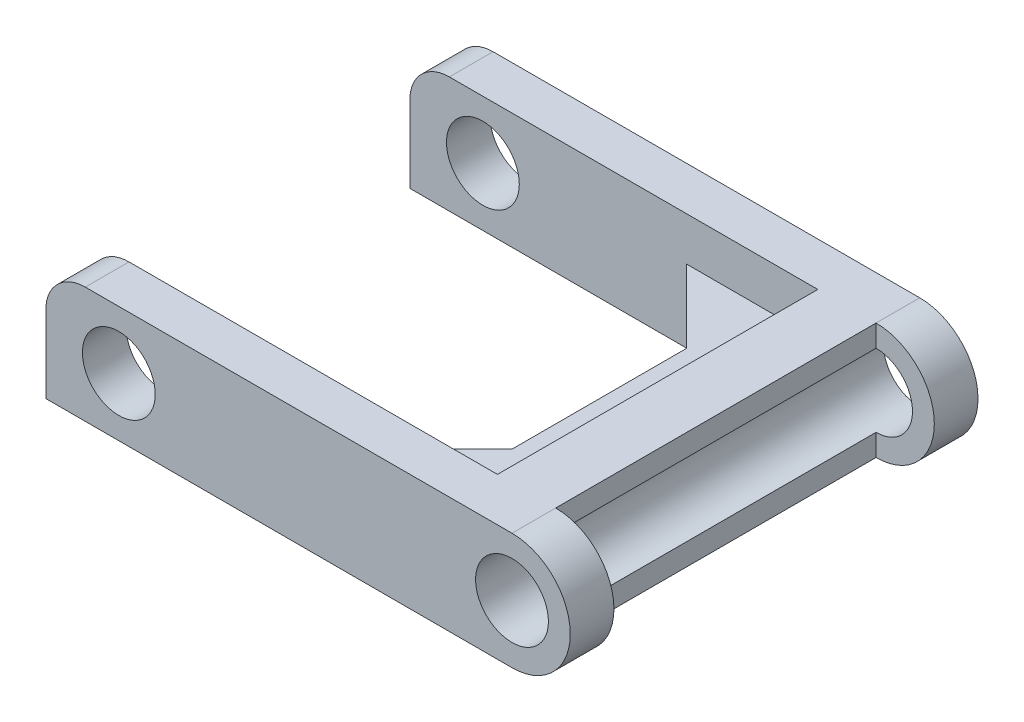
ISO-10303-21;
HEADER;
FILE_DESCRIPTION(('STEP AP214'),'2;1');
FILE_NAME('part.step','',(''),(''),'','','');
FILE_SCHEMA(('AUTOMOTIVE_DESIGN { 1 0 10303 214 1 1 1 1 }'));
ENDSEC;
DATA;
#1=APPLICATION_CONTEXT('core data for automotive mechanical design processes');
#2=APPLICATION_PROTOCOL_DEFINITION('international standard','automotive_design',2000,#1);
#3=PRODUCT_CONTEXT('',#1,'mechanical');
#4=PRODUCT('Part','Part','',(#3));
#5=PRODUCT_RELATED_PRODUCT_CATEGORY('part','',(#4));
#6=PRODUCT_DEFINITION_FORMATION('','',#4);
#7=PRODUCT_DEFINITION_CONTEXT('part definition',#1,'design');
#8=PRODUCT_DEFINITION('design','',#6,#7);
#9=PRODUCT_DEFINITION_SHAPE('','',#8);
#10=(LENGTH_UNIT() NAMED_UNIT(*) SI_UNIT(.MILLI.,.METRE.));
#11=(NAMED_UNIT(*) PLANE_ANGLE_UNIT() SI_UNIT($,.RADIAN.));
#12=(NAMED_UNIT(*) SI_UNIT($,.STERADIAN.) SOLID_ANGLE_UNIT());
#13=UNCERTAINTY_MEASURE_WITH_UNIT(LENGTH_MEASURE(1.E-05),#10,'distance_accuracy_value','');
#14=(GEOMETRIC_REPRESENTATION_CONTEXT(3) GLOBAL_UNCERTAINTY_ASSIGNED_CONTEXT((#13)) GLOBAL_UNIT_ASSIGNED_CONTEXT((#10,
#11,#12)) REPRESENTATION_CONTEXT('',''));
#15=CARTESIAN_POINT('',(0.,0.,0.));
#16=DIRECTION('',(0.,0.,1.));
#17=DIRECTION('',(1.,0.,0.));
#18=AXIS2_PLACEMENT_3D('',#15,#16,#17);
#19=CARTESIAN_POINT('',(109.496962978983,35.8309457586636,-1.50000024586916));
#20=DIRECTION('',(-1.,0.,0.));
#21=DIRECTION('',(0.,0.,1.));
#22=AXIS2_PLACEMENT_3D('',#19,#20,#21);
#23=PLANE('',#22);
#24=DIRECTION('',(0.,1.,0.));
#25=VECTOR('',#24,1.);
#26=CARTESIAN_POINT('',(109.496962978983,35.8309457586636,-12.5000001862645));
#27=LINE('',#26,#25);
#28=CARTESIAN_POINT('',(109.496962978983,38.3309458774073,-12.5000001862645));
#29=VERTEX_POINT('',#28);
#30=CARTESIAN_POINT('',(109.496962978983,39.8299193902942,-12.5000001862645));
#31=VERTEX_POINT('',#30);
#32=EDGE_CURVE('E234',#29,#31,#27,.T.);
#33=ORIENTED_EDGE('',*,*,#32,.F.);
#34=DIRECTION('',(0.,0.,-1.));
#35=VECTOR('',#34,1.);
#36=CARTESIAN_POINT('',(109.496962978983,38.3309458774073,-1.50000024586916));
#37=LINE('',#36,#35);
#38=CARTESIAN_POINT('',(109.496962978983,38.3309458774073,-1.50000024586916));
#39=VERTEX_POINT('',#38);
#40=EDGE_CURVE('E198',#39,#29,#37,.T.);
#41=ORIENTED_EDGE('',*,*,#40,.F.);
#42=DIRECTION('',(0.,1.,0.));
#43=VECTOR('',#42,1.);
#44=CARTESIAN_POINT('',(109.496962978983,35.8309457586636,-1.50000024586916));
#45=LINE('',#44,#43);
#46=CARTESIAN_POINT('',(109.496962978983,39.8299193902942,-1.50000024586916));
#47=VERTEX_POINT('',#46);
#48=EDGE_CURVE('E250',#39,#47,#45,.T.);
#49=ORIENTED_EDGE('',*,*,#48,.T.);
#50=DIRECTION('',(0.,0.,1.));
#51=VECTOR('',#50,1.);
#52=CARTESIAN_POINT('',(109.496962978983,39.8299193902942,-14.0000004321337));
#53=LINE('',#52,#51);
#54=EDGE_CURVE('E12',#31,#47,#53,.T.);
#55=ORIENTED_EDGE('',*,*,#54,.F.);
#56=EDGE_LOOP('',(#33,#41,#49,#55));
#57=FACE_BOUND('',#56,.T.);
#58=ADVANCED_FACE('F32',(#57),#23,.T.);
#59=CARTESIAN_POINT('',(111.496963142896,37.8309458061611,-14.0000004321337));
#60=DIRECTION('',(0.,0.,1.));
#61=DIRECTION('',(1.,0.,0.));
#62=AXIS2_PLACEMENT_3D('',#59,#60,#61);
#63=CYLINDRICAL_SURFACE('',#62,2.00000004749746);
#64=CARTESIAN_POINT('',(111.496963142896,37.8309458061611,-14.0000004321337));
#65=DIRECTION('',(0.,0.,1.));
#66=DIRECTION('',(1.,0.,0.));
#67=AXIS2_PLACEMENT_3D('',#64,#65,#66);
#68=CIRCLE('',#67,2.00000004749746);
#69=CARTESIAN_POINT('',(111.496963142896,35.8309457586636,-14.0000004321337));
#70=VERTEX_POINT('',#69);
#71=CARTESIAN_POINT('',(111.496962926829,39.8309458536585,-14.0000004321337));
#72=VERTEX_POINT('',#71);
#73=EDGE_CURVE('E291',#70,#72,#68,.T.);
#74=ORIENTED_EDGE('',*,*,#73,.T.);
#75=DIRECTION('',(0.,0.,1.));
#76=VECTOR('',#75,1.);
#77=CARTESIAN_POINT('',(111.496962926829,39.8309458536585,-14.0000004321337));
#78=LINE('',#77,#76);
#79=CARTESIAN_POINT('',(111.496962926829,39.8309458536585,-12.5000001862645));
#80=VERTEX_POINT('',#79);
#81=EDGE_CURVE('E332',#72,#80,#78,.T.);
#82=ORIENTED_EDGE('',*,*,#81,.T.);
#83=CARTESIAN_POINT('',(111.496963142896,37.8309458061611,-12.5000001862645));
#84=DIRECTION('',(0.,0.,1.));
#85=DIRECTION('',(1.,0.,0.));
#86=AXIS2_PLACEMENT_3D('',#83,#84,#85);
#87=CIRCLE('',#86,2.00000004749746);
#88=CARTESIAN_POINT('',(111.496963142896,35.8309457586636,-12.5000001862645));
#89=VERTEX_POINT('',#88);
#90=EDGE_CURVE('E256',#80,#89,#87,.F.);
#91=ORIENTED_EDGE('',*,*,#90,.T.);
#92=DIRECTION('',(0.,0.,1.));
#93=VECTOR('',#92,1.);
#94=CARTESIAN_POINT('',(111.496963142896,35.8309457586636,-14.0000004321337));
#95=LINE('',#94,#93);
#96=EDGE_CURVE('E319',#70,#89,#95,.T.);
#97=ORIENTED_EDGE('',*,*,#96,.F.);
#98=EDGE_LOOP('',(#74,#82,#91,#97));
#99=FACE_BOUND('',#98,.T.);
#100=ADVANCED_FACE('F34',(#99),#63,.T.);
#101=CARTESIAN_POINT('',(111.496963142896,39.8309458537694,-1.50000024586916));
#102=VERTEX_POINT('',#101);
#103=CARTESIAN_POINT('',(111.496962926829,39.8309458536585,0.));
#104=VERTEX_POINT('',#103);
#105=EDGE_CURVE('E306',#102,#104,#78,.T.);
#106=ORIENTED_EDGE('',*,*,#105,.T.);
#107=CARTESIAN_POINT('',(111.496963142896,37.8309458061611,0.));
#108=DIRECTION('',(0.,0.,1.));
#109=DIRECTION('',(1.,0.,0.));
#110=AXIS2_PLACEMENT_3D('',#107,#108,#109);
#111=CIRCLE('',#110,2.00000004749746);
#112=CARTESIAN_POINT('',(111.496963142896,35.8309457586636,0.));
#113=VERTEX_POINT('',#112);
#114=EDGE_CURVE('E288',#113,#104,#111,.T.);
#115=ORIENTED_EDGE('',*,*,#114,.F.);
#116=CARTESIAN_POINT('',(111.496963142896,35.8309457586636,-1.50000024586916));
#117=VERTEX_POINT('',#116);
#118=EDGE_CURVE('E323',#117,#113,#95,.T.);
#119=ORIENTED_EDGE('',*,*,#118,.F.);
#120=CARTESIAN_POINT('',(111.496963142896,37.8309458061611,-1.50000024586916));
#121=DIRECTION('',(0.,0.,-1.));
#122=DIRECTION('',(-1.,0.,0.));
#123=AXIS2_PLACEMENT_3D('',#120,#121,#122);
#124=CIRCLE('',#123,2.00000004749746);
#125=EDGE_CURVE('E238',#117,#102,#124,.F.);
#126=ORIENTED_EDGE('',*,*,#125,.T.);
#127=EDGE_LOOP('',(#106,#115,#119,#126));
#128=FACE_BOUND('',#127,.T.);
#129=ADVANCED_FACE('F371',(#128),#63,.T.);
#130=CARTESIAN_POINT('',(95.4969633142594,35.8309457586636,-14.0000004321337));
#131=DIRECTION('',(0.,-1.,0.));
#132=DIRECTION('',(0.,0.,-1.));
#133=AXIS2_PLACEMENT_3D('',#130,#131,#132);
#134=PLANE('',#133);
#135=DIRECTION('',(0.,0.,1.));
#136=VECTOR('',#135,1.);
#137=CARTESIAN_POINT('',(109.496962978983,35.8309457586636,-1.50000024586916));
#138=LINE('',#137,#136);
#139=CARTESIAN_POINT('',(109.496962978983,35.8309457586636,-12.5000001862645));
#140=VERTEX_POINT('',#139);
#141=CARTESIAN_POINT('',(109.496962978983,35.8309457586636,-1.50000024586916));
#142=VERTEX_POINT('',#141);
#143=EDGE_CURVE('E226',#140,#142,#138,.T.);
#144=ORIENTED_EDGE('',*,*,#143,.F.);
#145=DIRECTION('',(1.,0.,0.));
#146=VECTOR('',#145,1.);
#147=CARTESIAN_POINT('',(109.496962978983,35.8309457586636,-12.5000001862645));
#148=LINE('',#147,#146);
#149=CARTESIAN_POINT('',(95.4969633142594,35.8309457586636,-12.5000001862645));
#150=VERTEX_POINT('',#149);
#151=EDGE_CURVE('E221',#150,#140,#148,.T.);
#152=ORIENTED_EDGE('',*,*,#151,.F.);
#153=DIRECTION('',(0.,0.,1.));
#154=VECTOR('',#153,1.);
#155=CARTESIAN_POINT('',(95.4969633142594,35.8309457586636,-14.0000004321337));
#156=LINE('',#155,#154);
#157=CARTESIAN_POINT('',(95.4969633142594,35.8309457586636,-14.0000004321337));
#158=VERTEX_POINT('',#157);
#159=EDGE_CURVE('E324',#158,#150,#156,.T.);
#160=ORIENTED_EDGE('',*,*,#159,.F.);
#161=DIRECTION('',(1.,0.,0.));
#162=VECTOR('',#161,1.);
#163=CARTESIAN_POINT('',(95.4969633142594,35.8309457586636,-14.0000004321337));
#164=LINE('',#163,#162);
#165=EDGE_CURVE('E303',#158,#70,#164,.T.);
#166=ORIENTED_EDGE('',*,*,#165,.T.);
#167=ORIENTED_EDGE('',*,*,#96,.T.);
#168=DIRECTION('',(0.,0.,-1.));
#169=VECTOR('',#168,1.);
#170=CARTESIAN_POINT('',(111.496963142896,35.8309457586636,-12.5000001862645));
#171=LINE('',#170,#169);
#172=EDGE_CURVE('E231',#117,#89,#171,.T.);
#173=ORIENTED_EDGE('',*,*,#172,.F.);
#174=ORIENTED_EDGE('',*,*,#118,.T.);
#175=DIRECTION('',(1.,0.,0.));
#176=VECTOR('',#175,1.);
#177=CARTESIAN_POINT('',(95.4969633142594,35.8309457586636,0.));
#178=LINE('',#177,#176);
#179=CARTESIAN_POINT('',(95.4969633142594,35.8309457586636,0.));
#180=VERTEX_POINT('',#179);
#181=EDGE_CURVE('E294',#180,#113,#178,.T.);
#182=ORIENTED_EDGE('',*,*,#181,.F.);
#183=CARTESIAN_POINT('',(95.4969633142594,35.8309457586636,-1.50000024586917));
#184=VERTEX_POINT('',#183);
#185=EDGE_CURVE('E327',#184,#180,#156,.T.);
#186=ORIENTED_EDGE('',*,*,#185,.F.);
#187=DIRECTION('',(-1.,0.,0.));
#188=VECTOR('',#187,1.);
#189=CARTESIAN_POINT('',(104.996962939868,35.8309457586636,-1.50000024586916));
#190=LINE('',#189,#188);
#191=EDGE_CURVE('E229',#142,#184,#190,.T.);
#192=ORIENTED_EDGE('',*,*,#191,.F.);
#193=EDGE_LOOP('',(#144,#152,#160,#166,#167,#173,#174,#182,#186,#192));
#194=FACE_BOUND('',#193,.T.);
#195=ADVANCED_FACE('F444',(#194),#134,.T.);
#196=CARTESIAN_POINT('',(95.4969633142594,38.3309458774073,-14.0000004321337));
#197=DIRECTION('',(-1.,0.,0.));
#198=DIRECTION('',(0.,0.,1.));
#199=AXIS2_PLACEMENT_3D('',#196,#197,#198);
#200=PLANE('',#199);
#201=ORIENTED_EDGE('',*,*,#159,.T.);
#202=DIRECTION('',(0.,1.,0.));
#203=VECTOR('',#202,1.);
#204=CARTESIAN_POINT('',(95.4969633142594,35.8309457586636,-12.5000001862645));
#205=LINE('',#204,#203);
#206=CARTESIAN_POINT('',(95.4969633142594,38.6010464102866,-12.5000001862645));
#207=VERTEX_POINT('',#206);
#208=EDGE_CURVE('E235',#150,#207,#205,.T.);
#209=ORIENTED_EDGE('',*,*,#208,.T.);
#210=DIRECTION('',(0.,0.,1.));
#211=VECTOR('',#210,1.);
#212=CARTESIAN_POINT('',(95.4969633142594,38.6010464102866,-14.0000004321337));
#213=LINE('',#212,#211);
#214=CARTESIAN_POINT('',(95.4969633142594,38.6010464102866,-14.0000004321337));
#215=VERTEX_POINT('',#214);
#216=EDGE_CURVE('E275',#215,#207,#213,.T.);
#217=ORIENTED_EDGE('',*,*,#216,.F.);
#218=DIRECTION('',(0.,-1.,0.));
#219=VECTOR('',#218,1.);
#220=CARTESIAN_POINT('',(95.4969633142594,38.3309458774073,-14.0000004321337));
#221=LINE('',#220,#219);
#222=EDGE_CURVE('E300',#215,#158,#221,.T.);
#223=ORIENTED_EDGE('',*,*,#222,.T.);
#224=EDGE_LOOP('',(#201,#209,#217,#223));
#225=FACE_BOUND('',#224,.T.);
#226=ADVANCED_FACE('F449',(#225),#200,.T.);
#227=DIRECTION('',(0.,-1.,0.));
#228=VECTOR('',#227,1.);
#229=CARTESIAN_POINT('',(95.4969633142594,38.3309458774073,0.));
#230=LINE('',#229,#228);
#231=CARTESIAN_POINT('',(95.4969633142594,38.6010464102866,0.));
#232=VERTEX_POINT('',#231);
#233=EDGE_CURVE('E314',#232,#180,#230,.T.);
#234=ORIENTED_EDGE('',*,*,#233,.F.);
#235=DIRECTION('',(0.,0.,1.));
#236=VECTOR('',#235,1.);
#237=CARTESIAN_POINT('',(95.4969633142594,38.6010464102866,-14.0000004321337));
#238=LINE('',#237,#236);
#239=CARTESIAN_POINT('',(95.4969633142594,38.6010464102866,-1.50000024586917));
#240=VERTEX_POINT('',#239);
#241=EDGE_CURVE('E272',#240,#232,#238,.T.);
#242=ORIENTED_EDGE('',*,*,#241,.F.);
#243=DIRECTION('',(0.,1.,0.));
#244=VECTOR('',#243,1.);
#245=CARTESIAN_POINT('',(95.4969633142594,35.8309457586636,-1.50000024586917));
#246=LINE('',#245,#244);
#247=EDGE_CURVE('E245',#184,#240,#246,.T.);
#248=ORIENTED_EDGE('',*,*,#247,.F.);
#249=ORIENTED_EDGE('',*,*,#185,.T.);
#250=EDGE_LOOP('',(#234,#242,#248,#249));
#251=FACE_BOUND('',#250,.T.);
#252=ADVANCED_FACE('F467',(#251),#200,.T.);
#253=CARTESIAN_POINT('',(96.8476596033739,38.4659961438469,-14.0000004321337));
#254=DIRECTION('',(0.,0.,1.));
#255=DIRECTION('',(1.,0.,0.));
#256=AXIS2_PLACEMENT_3D('',#253,#254,#255);
#257=CYLINDRICAL_SURFACE('',#256,1.35743104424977);
#258=ORIENTED_EDGE('',*,*,#216,.T.);
#259=CARTESIAN_POINT('',(96.8476596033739,38.4659961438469,-12.5000001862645));
#260=DIRECTION('',(0.,0.,1.));
#261=DIRECTION('',(1.,0.,0.));
#262=AXIS2_PLACEMENT_3D('',#259,#260,#261);
#263=CIRCLE('',#262,1.35743104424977);
#264=CARTESIAN_POINT('',(96.8469629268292,39.8234270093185,-12.5000001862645));
#265=VERTEX_POINT('',#264);
#266=EDGE_CURVE('E269',#207,#265,#263,.F.);
#267=ORIENTED_EDGE('',*,*,#266,.T.);
#268=DIRECTION('',(0.,0.,1.));
#269=VECTOR('',#268,1.);
#270=CARTESIAN_POINT('',(96.8469629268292,39.8234270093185,-14.0000004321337));
#271=LINE('',#270,#269);
#272=CARTESIAN_POINT('',(96.8469629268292,39.8234270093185,-14.0000004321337));
#273=VERTEX_POINT('',#272);
#274=EDGE_CURVE('E328',#273,#265,#271,.T.);
#275=ORIENTED_EDGE('',*,*,#274,.F.);
#276=CARTESIAN_POINT('',(96.8476596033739,38.4659961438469,-14.0000004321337));
#277=DIRECTION('',(0.,0.,1.));
#278=DIRECTION('',(1.,0.,0.));
#279=AXIS2_PLACEMENT_3D('',#276,#277,#278);
#280=CIRCLE('',#279,1.35743104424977);
#281=EDGE_CURVE('E297',#273,#215,#280,.T.);
#282=ORIENTED_EDGE('',*,*,#281,.T.);
#283=EDGE_LOOP('',(#258,#267,#275,#282));
#284=FACE_BOUND('',#283,.T.);
#285=ADVANCED_FACE('F451',(#284),#257,.T.);
#286=CARTESIAN_POINT('',(96.8476596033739,38.4659961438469,-1.50000024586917));
#287=DIRECTION('',(0.,0.,-1.));
#288=DIRECTION('',(-1.,0.,0.));
#289=AXIS2_PLACEMENT_3D('',#286,#287,#288);
#290=CIRCLE('',#289,1.35743104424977);
#291=CARTESIAN_POINT('',(96.8469629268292,39.8234270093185,-1.50000024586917));
#292=VERTEX_POINT('',#291);
#293=EDGE_CURVE('E262',#292,#240,#290,.F.);
#294=ORIENTED_EDGE('',*,*,#293,.T.);
#295=ORIENTED_EDGE('',*,*,#241,.T.);
#296=CARTESIAN_POINT('',(96.8476596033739,38.4659961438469,0.));
#297=DIRECTION('',(0.,0.,1.));
#298=DIRECTION('',(1.,0.,0.));
#299=AXIS2_PLACEMENT_3D('',#296,#297,#298);
#300=CIRCLE('',#299,1.35743104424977);
#301=CARTESIAN_POINT('',(96.8469629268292,39.8234270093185,0.));
#302=VERTEX_POINT('',#301);
#303=EDGE_CURVE('E311',#302,#232,#300,.T.);
#304=ORIENTED_EDGE('',*,*,#303,.F.);
#305=EDGE_CURVE('E331',#292,#302,#271,.T.);
#306=ORIENTED_EDGE('',*,*,#305,.F.);
#307=EDGE_LOOP('',(#294,#295,#304,#306));
#308=FACE_BOUND('',#307,.T.);
#309=ADVANCED_FACE('F457',(#308),#257,.T.);
#310=CARTESIAN_POINT('',(111.496962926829,39.8309458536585,-14.0000004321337));
#311=DIRECTION('',(-0.000513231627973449,0.999999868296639,0.));
#312=DIRECTION('',(-0.999999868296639,-0.000513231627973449,0.));
#313=AXIS2_PLACEMENT_3D('',#310,#311,#312);
#314=PLANE('',#313);
#315=ORIENTED_EDGE('',*,*,#274,.T.);
#316=DIRECTION('',(0.999999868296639,0.000513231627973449,0.));
#317=VECTOR('',#316,1.);
#318=CARTESIAN_POINT('',(111.496962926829,39.8309458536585,-12.5000001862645));
#319=LINE('',#318,#317);
#320=EDGE_CURVE('E266',#265,#31,#319,.T.);
#321=ORIENTED_EDGE('',*,*,#320,.T.);
#322=ORIENTED_EDGE('',*,*,#54,.T.);
#323=DIRECTION('',(-0.999999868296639,-0.000513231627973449,0.));
#324=VECTOR('',#323,1.);
#325=CARTESIAN_POINT('',(111.496962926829,39.8309458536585,-1.50000024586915));
#326=LINE('',#325,#324);
#327=EDGE_CURVE('E259',#47,#292,#326,.T.);
#328=ORIENTED_EDGE('',*,*,#327,.T.);
#329=ORIENTED_EDGE('',*,*,#305,.T.);
#330=DIRECTION('',(-0.999999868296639,-0.000513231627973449,0.));
#331=VECTOR('',#330,1.);
#332=CARTESIAN_POINT('',(111.496962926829,39.8309458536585,0.));
#333=LINE('',#332,#331);
#334=EDGE_CURVE('E308',#104,#302,#333,.T.);
#335=ORIENTED_EDGE('',*,*,#334,.F.);
#336=ORIENTED_EDGE('',*,*,#105,.F.);
#337=DIRECTION('',(0.,0.,-1.));
#338=VECTOR('',#337,1.);
#339=CARTESIAN_POINT('',(111.496963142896,39.8309458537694,-14.0000004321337));
#340=LINE('',#339,#338);
#341=EDGE_CURVE('E253',#102,#80,#340,.T.);
#342=ORIENTED_EDGE('',*,*,#341,.T.);
#343=ORIENTED_EDGE('',*,*,#81,.F.);
#344=DIRECTION('',(-0.999999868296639,-0.000513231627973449,0.));
#345=VECTOR('',#344,1.);
#346=CARTESIAN_POINT('',(111.496962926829,39.8309458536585,-14.0000004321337));
#347=LINE('',#346,#345);
#348=EDGE_CURVE('E293',#72,#273,#347,.T.);
#349=ORIENTED_EDGE('',*,*,#348,.T.);
#350=EDGE_LOOP('',(#315,#321,#322,#328,#329,#335,#336,#342,#343,#349));
#351=FACE_BOUND('',#350,.T.);
#352=ADVANCED_FACE('F434',(#351),#314,.T.);
#353=CARTESIAN_POINT('',(111.496963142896,37.8309458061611,-14.0000004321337));
#354=DIRECTION('',(0.,0.,1.));
#355=DIRECTION('',(1.,0.,0.));
#356=AXIS2_PLACEMENT_3D('',#353,#354,#355);
#357=PLANE('',#356);
#358=CARTESIAN_POINT('',(97.9969629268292,37.8309458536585,-14.0000004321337));
#359=DIRECTION('',(0.,0.,1.));
#360=DIRECTION('',(1.,0.,0.));
#361=AXIS2_PLACEMENT_3D('',#358,#359,#360);
#362=CIRCLE('',#361,1.25);
#363=CARTESIAN_POINT('',(99.2469629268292,37.8309458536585,-14.0000004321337));
#364=VERTEX_POINT('',#363);
#365=EDGE_CURVE('E285',#364,#364,#362,.T.);
#366=ORIENTED_EDGE('',*,*,#365,.T.);
#367=EDGE_LOOP('',(#366));
#368=FACE_BOUND('',#367,.T.);
#369=CARTESIAN_POINT('',(111.496963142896,37.8309458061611,-14.0000004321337));
#370=DIRECTION('',(0.,0.,1.));
#371=DIRECTION('',(1.,0.,0.));
#372=AXIS2_PLACEMENT_3D('',#369,#370,#371);
#373=CIRCLE('',#372,1.24999978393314);
#374=CARTESIAN_POINT('',(112.746962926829,37.8309458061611,-14.0000004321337));
#375=VERTEX_POINT('',#374);
#376=EDGE_CURVE('E279',#375,#375,#373,.T.);
#377=ORIENTED_EDGE('',*,*,#376,.T.);
#378=EDGE_LOOP('',(#377));
#379=FACE_BOUND('',#378,.T.);
#380=ORIENTED_EDGE('',*,*,#222,.F.);
#381=ORIENTED_EDGE('',*,*,#281,.F.);
#382=ORIENTED_EDGE('',*,*,#348,.F.);
#383=ORIENTED_EDGE('',*,*,#73,.F.);
#384=ORIENTED_EDGE('',*,*,#165,.F.);
#385=EDGE_LOOP('',(#380,#381,#382,#383,#384));
#386=FACE_BOUND('',#385,.T.);
#387=ADVANCED_FACE('F358',(#368,#379,#386),#357,.F.);
#388=CARTESIAN_POINT('',(111.496963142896,37.8309458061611,0.));
#389=DIRECTION('',(0.,0.,1.));
#390=DIRECTION('',(1.,0.,0.));
#391=AXIS2_PLACEMENT_3D('',#388,#389,#390);
#392=PLANE('',#391);
#393=CARTESIAN_POINT('',(97.9969629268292,37.8309458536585,0.));
#394=DIRECTION('',(0.,0.,1.));
#395=DIRECTION('',(1.,0.,0.));
#396=AXIS2_PLACEMENT_3D('',#393,#394,#395);
#397=CIRCLE('',#396,1.25);
#398=CARTESIAN_POINT('',(99.2469629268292,37.8309458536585,0.));
#399=VERTEX_POINT('',#398);
#400=EDGE_CURVE('E282',#399,#399,#397,.T.);
#401=ORIENTED_EDGE('',*,*,#400,.F.);
#402=EDGE_LOOP('',(#401));
#403=FACE_BOUND('',#402,.T.);
#404=CARTESIAN_POINT('',(111.496963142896,37.8309458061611,0.));
#405=DIRECTION('',(0.,0.,1.));
#406=DIRECTION('',(1.,0.,0.));
#407=AXIS2_PLACEMENT_3D('',#404,#405,#406);
#408=CIRCLE('',#407,1.24999978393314);
#409=CARTESIAN_POINT('',(112.746962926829,37.8309458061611,0.));
#410=VERTEX_POINT('',#409);
#411=EDGE_CURVE('E278',#410,#410,#408,.T.);
#412=ORIENTED_EDGE('',*,*,#411,.F.);
#413=EDGE_LOOP('',(#412));
#414=FACE_BOUND('',#413,.T.);
#415=ORIENTED_EDGE('',*,*,#303,.T.);
#416=ORIENTED_EDGE('',*,*,#233,.T.);
#417=ORIENTED_EDGE('',*,*,#181,.T.);
#418=ORIENTED_EDGE('',*,*,#114,.T.);
#419=ORIENTED_EDGE('',*,*,#334,.T.);
#420=EDGE_LOOP('',(#415,#416,#417,#418,#419));
#421=FACE_BOUND('',#420,.T.);
#422=ADVANCED_FACE('F349',(#403,#414,#421),#392,.T.);
#423=CARTESIAN_POINT('',(97.9969629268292,37.8309458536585,-14.0000004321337));
#424=DIRECTION('',(0.,0.,1.));
#425=DIRECTION('',(1.,0.,0.));
#426=AXIS2_PLACEMENT_3D('',#423,#424,#425);
#427=CYLINDRICAL_SURFACE('',#426,1.25);
#428=ORIENTED_EDGE('',*,*,#365,.F.);
#429=EDGE_LOOP('',(#428));
#430=FACE_BOUND('',#429,.T.);
#431=CARTESIAN_POINT('',(97.9969629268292,37.8309458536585,-12.5000001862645));
#432=DIRECTION('',(0.,0.,1.));
#433=DIRECTION('',(1.,0.,0.));
#434=AXIS2_PLACEMENT_3D('',#431,#432,#433);
#435=CIRCLE('',#434,1.25);
#436=CARTESIAN_POINT('',(99.2469629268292,37.8309458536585,-12.5000001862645));
#437=VERTEX_POINT('',#436);
#438=EDGE_CURVE('E265',#437,#437,#435,.F.);
#439=ORIENTED_EDGE('',*,*,#438,.F.);
#440=EDGE_LOOP('',(#439));
#441=FACE_BOUND('',#440,.T.);
#442=ADVANCED_FACE('F346',(#430,#441),#427,.F.);
#443=ORIENTED_EDGE('',*,*,#400,.T.);
#444=EDGE_LOOP('',(#443));
#445=FACE_BOUND('',#444,.T.);
#446=CARTESIAN_POINT('',(97.9969629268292,37.8309458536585,-1.50000024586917));
#447=DIRECTION('',(0.,0.,-1.));
#448=DIRECTION('',(-1.,0.,0.));
#449=AXIS2_PLACEMENT_3D('',#446,#447,#448);
#450=CIRCLE('',#449,1.25);
#451=CARTESIAN_POINT('',(96.7469629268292,37.8309458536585,-1.50000024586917));
#452=VERTEX_POINT('',#451);
#453=EDGE_CURVE('E258',#452,#452,#450,.F.);
#454=ORIENTED_EDGE('',*,*,#453,.F.);
#455=EDGE_LOOP('',(#454));
#456=FACE_BOUND('',#455,.T.);
#457=ADVANCED_FACE('F348',(#445,#456),#427,.F.);
#458=CARTESIAN_POINT('',(111.496963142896,37.8309458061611,-14.0000004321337));
#459=DIRECTION('',(0.,0.,1.));
#460=DIRECTION('',(1.,0.,0.));
#461=AXIS2_PLACEMENT_3D('',#458,#459,#460);
#462=CYLINDRICAL_SURFACE('',#461,1.24999978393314);
#463=ORIENTED_EDGE('',*,*,#411,.T.);
#464=EDGE_LOOP('',(#463));
#465=FACE_BOUND('',#464,.T.);
#466=ORIENTED_EDGE('',*,*,#376,.F.);
#467=EDGE_LOOP('',(#466));
#468=FACE_BOUND('',#467,.T.);
#469=CARTESIAN_POINT('',(111.496963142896,37.8309458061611,-12.5000001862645));
#470=DIRECTION('',(0.,0.,1.));
#471=DIRECTION('',(1.,0.,0.));
#472=AXIS2_PLACEMENT_3D('',#469,#470,#471);
#473=CIRCLE('',#472,1.24999978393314);
#474=CARTESIAN_POINT('',(111.496963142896,39.0809455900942,-12.5000001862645));
#475=VERTEX_POINT('',#474);
#476=CARTESIAN_POINT('',(111.496963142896,36.5809460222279,-12.5000001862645));
#477=VERTEX_POINT('',#476);
#478=EDGE_CURVE('E40',#475,#477,#473,.F.);
#479=ORIENTED_EDGE('',*,*,#478,.F.);
#480=DIRECTION('',(0.,0.,1.));
#481=VECTOR('',#480,1.);
#482=CARTESIAN_POINT('',(111.496963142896,39.0809455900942,-14.0000004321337));
#483=LINE('',#482,#481);
#484=CARTESIAN_POINT('',(111.496963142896,39.0809455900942,-1.50000024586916));
#485=VERTEX_POINT('',#484);
#486=EDGE_CURVE('E339',#485,#475,#483,.F.);
#487=ORIENTED_EDGE('',*,*,#486,.F.);
#488=CARTESIAN_POINT('',(111.496963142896,37.8309458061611,-1.50000024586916));
#489=DIRECTION('',(0.,0.,-1.));
#490=DIRECTION('',(-1.,0.,0.));
#491=AXIS2_PLACEMENT_3D('',#488,#489,#490);
#492=CIRCLE('',#491,1.24999978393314);
#493=CARTESIAN_POINT('',(111.496963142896,36.5809460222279,-1.50000024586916));
#494=VERTEX_POINT('',#493);
#495=EDGE_CURVE('E322',#494,#485,#492,.F.);
#496=ORIENTED_EDGE('',*,*,#495,.F.);
#497=DIRECTION('',(0.,0.,1.));
#498=VECTOR('',#497,1.);
#499=CARTESIAN_POINT('',(111.496963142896,36.5809460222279,-14.0000004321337));
#500=LINE('',#499,#498);
#501=EDGE_CURVE('E336',#477,#494,#500,.T.);
#502=ORIENTED_EDGE('',*,*,#501,.F.);
#503=EDGE_LOOP('',(#479,#487,#496,#502));
#504=FACE_BOUND('',#503,.T.);
#505=ADVANCED_FACE('F356',(#465,#468,#504),#462,.F.);
#506=CARTESIAN_POINT('',(111.496963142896,35.8309457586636,-1.50000024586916));
#507=DIRECTION('',(0.,0.,-1.));
#508=DIRECTION('',(-1.,0.,0.));
#509=AXIS2_PLACEMENT_3D('',#506,#507,#508);
#510=PLANE('',#509);
#511=DIRECTION('',(0.,1.,0.));
#512=VECTOR('',#511,1.);
#513=CARTESIAN_POINT('',(111.496963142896,35.8309457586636,-1.50000024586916));
#514=LINE('',#513,#512);
#515=EDGE_CURVE('E242',#117,#494,#514,.T.);
#516=ORIENTED_EDGE('',*,*,#515,.T.);
#517=ORIENTED_EDGE('',*,*,#495,.T.);
#518=EDGE_CURVE('E244',#485,#102,#514,.T.);
#519=ORIENTED_EDGE('',*,*,#518,.T.);
#520=ORIENTED_EDGE('',*,*,#125,.F.);
#521=EDGE_LOOP('',(#516,#517,#519,#520));
#522=FACE_BOUND('',#521,.T.);
#523=ADVANCED_FACE('F412',(#522),#510,.T.);
#524=CARTESIAN_POINT('',(111.496963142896,35.8309457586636,-12.5000001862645));
#525=DIRECTION('',(1.,0.,0.));
#526=DIRECTION('',(0.,0.,-1.));
#527=AXIS2_PLACEMENT_3D('',#524,#525,#526);
#528=PLANE('',#527);
#529=ORIENTED_EDGE('',*,*,#501,.T.);
#530=ORIENTED_EDGE('',*,*,#515,.F.);
#531=ORIENTED_EDGE('',*,*,#172,.T.);
#532=DIRECTION('',(0.,1.,0.));
#533=VECTOR('',#532,1.);
#534=CARTESIAN_POINT('',(111.496963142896,35.8309457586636,-12.5000001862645));
#535=LINE('',#534,#533);
#536=EDGE_CURVE('E239',#89,#477,#535,.T.);
#537=ORIENTED_EDGE('',*,*,#536,.T.);
#538=EDGE_LOOP('',(#529,#530,#531,#537));
#539=FACE_BOUND('',#538,.T.);
#540=ADVANCED_FACE('F411',(#539),#528,.T.);
#541=ORIENTED_EDGE('',*,*,#518,.F.);
#542=ORIENTED_EDGE('',*,*,#486,.T.);
#543=EDGE_CURVE('E55',#475,#80,#535,.T.);
#544=ORIENTED_EDGE('',*,*,#543,.T.);
#545=ORIENTED_EDGE('',*,*,#341,.F.);
#546=EDGE_LOOP('',(#541,#542,#544,#545));
#547=FACE_BOUND('',#546,.T.);
#548=ADVANCED_FACE('F407',(#547),#528,.T.);
#549=CARTESIAN_POINT('',(113.496962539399,35.8309457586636,-12.5000001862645));
#550=DIRECTION('',(0.,0.,1.));
#551=DIRECTION('',(1.,0.,0.));
#552=AXIS2_PLACEMENT_3D('',#549,#550,#551);
#553=PLANE('',#552);
#554=ORIENTED_EDGE('',*,*,#90,.F.);
#555=ORIENTED_EDGE('',*,*,#543,.F.);
#556=ORIENTED_EDGE('',*,*,#478,.T.);
#557=ORIENTED_EDGE('',*,*,#536,.F.);
#558=EDGE_LOOP('',(#554,#555,#556,#557));
#559=FACE_BOUND('',#558,.T.);
#560=ADVANCED_FACE('F404',(#559),#553,.T.);
#561=CARTESIAN_POINT('',(104.996962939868,35.8309457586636,-12.5000001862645));
#562=DIRECTION('',(0.,0.,1.));
#563=DIRECTION('',(1.,0.,0.));
#564=AXIS2_PLACEMENT_3D('',#561,#562,#563);
#565=PLANE('',#564);
#566=DIRECTION('',(-1.,0.,0.));
#567=VECTOR('',#566,1.);
#568=CARTESIAN_POINT('',(109.496962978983,37.3309458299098,-12.5000001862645));
#569=LINE('',#568,#567);
#570=CARTESIAN_POINT('',(109.496962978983,37.3309458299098,-12.5000001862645));
#571=VERTEX_POINT('',#570);
#572=CARTESIAN_POINT('',(104.996962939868,37.3309458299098,-12.5000001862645));
#573=VERTEX_POINT('',#572);
#574=EDGE_CURVE('E187',#571,#573,#569,.T.);
#575=ORIENTED_EDGE('',*,*,#574,.T.);
#576=DIRECTION('',(0.,1.,0.));
#577=VECTOR('',#576,1.);
#578=CARTESIAN_POINT('',(104.996962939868,37.3309458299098,-12.5000001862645));
#579=LINE('',#578,#577);
#580=CARTESIAN_POINT('',(104.996962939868,38.3309458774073,-12.5000001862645));
#581=VERTEX_POINT('',#580);
#582=EDGE_CURVE('E171',#573,#581,#579,.T.);
#583=ORIENTED_EDGE('',*,*,#582,.T.);
#584=DIRECTION('',(-1.,0.,0.));
#585=VECTOR('',#584,1.);
#586=CARTESIAN_POINT('',(109.496962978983,38.3309458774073,-12.5000001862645));
#587=LINE('',#586,#585);
#588=EDGE_CURVE('E210',#29,#581,#587,.T.);
#589=ORIENTED_EDGE('',*,*,#588,.F.);
#590=ORIENTED_EDGE('',*,*,#32,.T.);
#591=ORIENTED_EDGE('',*,*,#320,.F.);
#592=ORIENTED_EDGE('',*,*,#266,.F.);
#593=ORIENTED_EDGE('',*,*,#208,.F.);
#594=ORIENTED_EDGE('',*,*,#151,.T.);
#595=EDGE_CURVE('E197',#140,#571,#27,.T.);
#596=ORIENTED_EDGE('',*,*,#595,.T.);
#597=EDGE_LOOP('',(#575,#583,#589,#590,#591,#592,#593,#594,#596));
#598=FACE_BOUND('',#597,.T.);
#599=ORIENTED_EDGE('',*,*,#438,.T.);
#600=EDGE_LOOP('',(#599));
#601=FACE_BOUND('',#600,.T.);
#602=ADVANCED_FACE('F194',(#598,#601),#565,.T.);
#603=CARTESIAN_POINT('',(95.4969633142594,35.8309457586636,-1.50000024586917));
#604=DIRECTION('',(0.,0.,-1.));
#605=DIRECTION('',(-1.,0.,0.));
#606=AXIS2_PLACEMENT_3D('',#603,#604,#605);
#607=PLANE('',#606);
#608=DIRECTION('',(1.,0.,0.));
#609=VECTOR('',#608,1.);
#610=CARTESIAN_POINT('',(104.996962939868,37.3309458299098,-1.50000024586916));
#611=LINE('',#610,#609);
#612=CARTESIAN_POINT('',(104.996962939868,37.3309458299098,-1.50000024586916));
#613=VERTEX_POINT('',#612);
#614=CARTESIAN_POINT('',(109.496962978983,37.3309458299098,-1.50000024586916));
#615=VERTEX_POINT('',#614);
#616=EDGE_CURVE('E206',#613,#615,#611,.T.);
#617=ORIENTED_EDGE('',*,*,#616,.T.);
#618=EDGE_CURVE('E247',#142,#615,#45,.T.);
#619=ORIENTED_EDGE('',*,*,#618,.F.);
#620=ORIENTED_EDGE('',*,*,#191,.T.);
#621=ORIENTED_EDGE('',*,*,#247,.T.);
#622=ORIENTED_EDGE('',*,*,#293,.F.);
#623=ORIENTED_EDGE('',*,*,#327,.F.);
#624=ORIENTED_EDGE('',*,*,#48,.F.);
#625=DIRECTION('',(1.,0.,0.));
#626=VECTOR('',#625,1.);
#627=CARTESIAN_POINT('',(104.996962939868,38.3309458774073,-1.50000024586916));
#628=LINE('',#627,#626);
#629=CARTESIAN_POINT('',(104.996962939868,38.3309458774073,-1.50000024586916));
#630=VERTEX_POINT('',#629);
#631=EDGE_CURVE('E47',#630,#39,#628,.T.);
#632=ORIENTED_EDGE('',*,*,#631,.F.);
#633=DIRECTION('',(0.,1.,0.));
#634=VECTOR('',#633,1.);
#635=CARTESIAN_POINT('',(104.996962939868,37.3309458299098,-1.50000024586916));
#636=LINE('',#635,#634);
#637=EDGE_CURVE('E219',#613,#630,#636,.T.);
#638=ORIENTED_EDGE('',*,*,#637,.F.);
#639=EDGE_LOOP('',(#617,#619,#620,#621,#622,#623,#624,#632,#638));
#640=FACE_BOUND('',#639,.T.);
#641=ORIENTED_EDGE('',*,*,#453,.T.);
#642=EDGE_LOOP('',(#641));
#643=FACE_BOUND('',#642,.T.);
#644=ADVANCED_FACE('F377',(#640,#643),#607,.T.);
#645=DIRECTION('',(0.,0.,-1.));
#646=VECTOR('',#645,1.);
#647=CARTESIAN_POINT('',(109.496962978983,37.3309458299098,-1.50000024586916));
#648=LINE('',#647,#646);
#649=EDGE_CURVE('E182',#615,#571,#648,.T.);
#650=ORIENTED_EDGE('',*,*,#649,.T.);
#651=ORIENTED_EDGE('',*,*,#595,.F.);
#652=ORIENTED_EDGE('',*,*,#143,.T.);
#653=ORIENTED_EDGE('',*,*,#618,.T.);
#654=EDGE_LOOP('',(#650,#651,#652,#653));
#655=FACE_BOUND('',#654,.T.);
#656=ADVANCED_FACE('F367',(#655),#23,.T.);
#657=CARTESIAN_POINT('',(104.996962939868,37.3309458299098,-1.50000024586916));
#658=DIRECTION('',(-0.707106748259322,0.,-0.707106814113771));
#659=DIRECTION('',(-0.707106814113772,0.,0.707106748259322));
#660=AXIS2_PLACEMENT_3D('',#657,#658,#659);
#661=PLANE('',#660);
#662=DIRECTION('',(-0.707106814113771,0.,0.707106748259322));
#663=VECTOR('',#662,1.);
#664=CARTESIAN_POINT('',(104.996962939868,38.3309458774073,-1.50000024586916));
#665=LINE('',#664,#663);
#666=CARTESIAN_POINT('',(107.496963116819,38.3309458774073,-4.00000018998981));
#667=VERTEX_POINT('',#666);
#668=EDGE_CURVE('E216',#667,#630,#665,.T.);
#669=ORIENTED_EDGE('',*,*,#668,.F.);
#670=DIRECTION('',(0.,1.,0.));
#671=VECTOR('',#670,1.);
#672=CARTESIAN_POINT('',(107.496963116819,37.3309458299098,-4.00000018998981));
#673=LINE('',#672,#671);
#674=CARTESIAN_POINT('',(107.496963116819,37.3309458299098,-4.00000018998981));
#675=VERTEX_POINT('',#674);
#676=EDGE_CURVE('E222',#675,#667,#673,.T.);
#677=ORIENTED_EDGE('',*,*,#676,.F.);
#678=DIRECTION('',(-0.707106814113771,0.,0.707106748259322));
#679=VECTOR('',#678,1.);
#680=CARTESIAN_POINT('',(104.996962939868,37.3309458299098,-1.50000024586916));
#681=LINE('',#680,#679);
#682=EDGE_CURVE('E203',#675,#613,#681,.T.);
#683=ORIENTED_EDGE('',*,*,#682,.T.);
#684=ORIENTED_EDGE('',*,*,#637,.T.);
#685=EDGE_LOOP('',(#669,#677,#683,#684));
#686=FACE_BOUND('',#685,.T.);
#687=ADVANCED_FACE('F376',(#686),#661,.T.);
#688=CARTESIAN_POINT('',(107.496963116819,37.3309458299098,-4.00000018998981));
#689=DIRECTION('',(-1.,0.,0.));
#690=DIRECTION('',(0.,0.,1.));
#691=AXIS2_PLACEMENT_3D('',#688,#689,#690);
#692=PLANE('',#691);
#693=DIRECTION('',(0.,0.,1.));
#694=VECTOR('',#693,1.);
#695=CARTESIAN_POINT('',(107.496963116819,38.3309458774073,-4.00000018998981));
#696=LINE('',#695,#694);
#697=CARTESIAN_POINT('',(107.496963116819,38.3309458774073,-10.0000002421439));
#698=VERTEX_POINT('',#697);
#699=EDGE_CURVE('E213',#698,#667,#696,.T.);
#700=ORIENTED_EDGE('',*,*,#699,.F.);
#701=DIRECTION('',(0.,1.,0.));
#702=VECTOR('',#701,1.);
#703=CARTESIAN_POINT('',(107.496963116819,37.3309458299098,-10.0000002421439));
#704=LINE('',#703,#702);
#705=CARTESIAN_POINT('',(107.496963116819,37.3309458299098,-10.0000002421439));
#706=VERTEX_POINT('',#705);
#707=EDGE_CURVE('E181',#706,#698,#704,.T.);
#708=ORIENTED_EDGE('',*,*,#707,.F.);
#709=DIRECTION('',(0.,0.,1.));
#710=VECTOR('',#709,1.);
#711=CARTESIAN_POINT('',(107.496963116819,37.3309458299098,-4.00000018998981));
#712=LINE('',#711,#710);
#713=EDGE_CURVE('E191',#706,#675,#712,.T.);
#714=ORIENTED_EDGE('',*,*,#713,.T.);
#715=ORIENTED_EDGE('',*,*,#676,.T.);
#716=EDGE_LOOP('',(#700,#708,#714,#715));
#717=FACE_BOUND('',#716,.T.);
#718=ADVANCED_FACE('F383',(#717),#692,.T.);
#719=CARTESIAN_POINT('',(107.496963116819,37.3309458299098,-10.0000002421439));
#720=DIRECTION('',(-0.707106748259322,0.,0.707106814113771));
#721=DIRECTION('',(0.707106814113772,0.,0.707106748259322));
#722=AXIS2_PLACEMENT_3D('',#719,#720,#721);
#723=PLANE('',#722);
#724=DIRECTION('',(0.707106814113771,0.,0.707106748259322));
#725=VECTOR('',#724,1.);
#726=CARTESIAN_POINT('',(107.496963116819,38.3309458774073,-10.0000002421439));
#727=LINE('',#726,#725);
#728=EDGE_CURVE('E176',#581,#698,#727,.T.);
#729=ORIENTED_EDGE('',*,*,#728,.F.);
#730=ORIENTED_EDGE('',*,*,#582,.F.);
#731=DIRECTION('',(0.707106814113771,0.,0.707106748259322));
#732=VECTOR('',#731,1.);
#733=CARTESIAN_POINT('',(107.496963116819,37.3309458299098,-10.0000002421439));
#734=LINE('',#733,#732);
#735=EDGE_CURVE('E174',#573,#706,#734,.T.);
#736=ORIENTED_EDGE('',*,*,#735,.T.);
#737=ORIENTED_EDGE('',*,*,#707,.T.);
#738=EDGE_LOOP('',(#729,#730,#736,#737));
#739=FACE_BOUND('',#738,.T.);
#740=ADVANCED_FACE('F173',(#739),#723,.T.);
#741=CARTESIAN_POINT('',(107.496963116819,37.3309458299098,-12.5000001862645));
#742=DIRECTION('',(0.,-1.,0.));
#743=DIRECTION('',(0.,0.,-1.));
#744=AXIS2_PLACEMENT_3D('',#741,#742,#743);
#745=PLANE('',#744);
#746=ORIENTED_EDGE('',*,*,#574,.F.);
#747=ORIENTED_EDGE('',*,*,#649,.F.);
#748=ORIENTED_EDGE('',*,*,#616,.F.);
#749=ORIENTED_EDGE('',*,*,#682,.F.);
#750=ORIENTED_EDGE('',*,*,#713,.F.);
#751=ORIENTED_EDGE('',*,*,#735,.F.);
#752=EDGE_LOOP('',(#746,#747,#748,#749,#750,#751));
#753=FACE_BOUND('',#752,.T.);
#754=ADVANCED_FACE('F186',(#753),#745,.T.);
#755=CARTESIAN_POINT('',(107.496963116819,38.3309458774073,-12.5000001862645));
#756=DIRECTION('',(0.,-1.,0.));
#757=DIRECTION('',(0.,0.,-1.));
#758=AXIS2_PLACEMENT_3D('',#755,#756,#757);
#759=PLANE('',#758);
#760=ORIENTED_EDGE('',*,*,#588,.T.);
#761=ORIENTED_EDGE('',*,*,#728,.T.);
#762=ORIENTED_EDGE('',*,*,#699,.T.);
#763=ORIENTED_EDGE('',*,*,#668,.T.);
#764=ORIENTED_EDGE('',*,*,#631,.T.);
#765=ORIENTED_EDGE('',*,*,#40,.T.);
#766=EDGE_LOOP('',(#760,#761,#762,#763,#764,#765));
#767=FACE_BOUND('',#766,.T.);
#768=ADVANCED_FACE('F391',(#767),#759,.F.);
#769=CLOSED_SHELL('',(#58,#100,#129,#195,#226,#252,#285,#309,#352,#387,#422,#442,#457,#505,#523,
#540,#548,#560,#602,#644,#656,#687,#718,#740,#754,#768));
#770=MANIFOLD_SOLID_BREP('B2',#769);
#771=ADVANCED_BREP_SHAPE_REPRESENTATION('',(#18,#770),#14);
#772=SHAPE_DEFINITION_REPRESENTATION(#9,#771);
ENDSEC;
END-ISO-10303-21;
